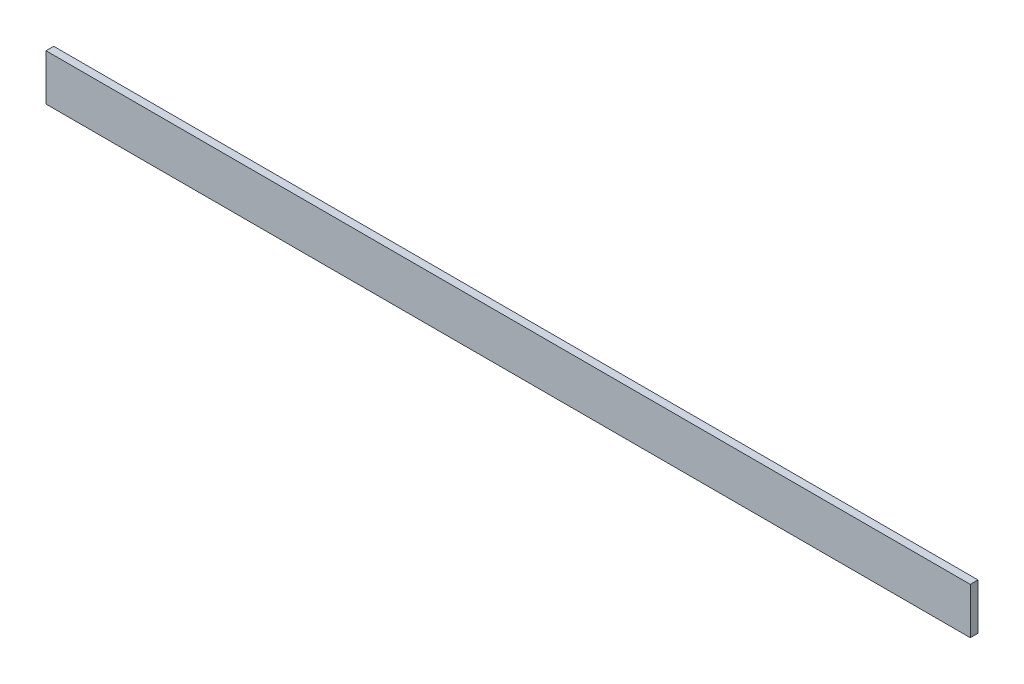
from build123d import *

# Parameters (mm, degrees)
ESQUISSE1_W      = 1200
ESQUISSE1_H      = 60
EXTRUSION1_DEPTH = 10


with BuildPart() as part:
    # Esquisse1 → Extrusion1 (new body)
    with BuildSketch(Plane.XY):
        with Locations((600, 30)):
            Rectangle(ESQUISSE1_W, ESQUISSE1_H)
    extrude(amount=EXTRUSION1_DEPTH)


solid = part.part
